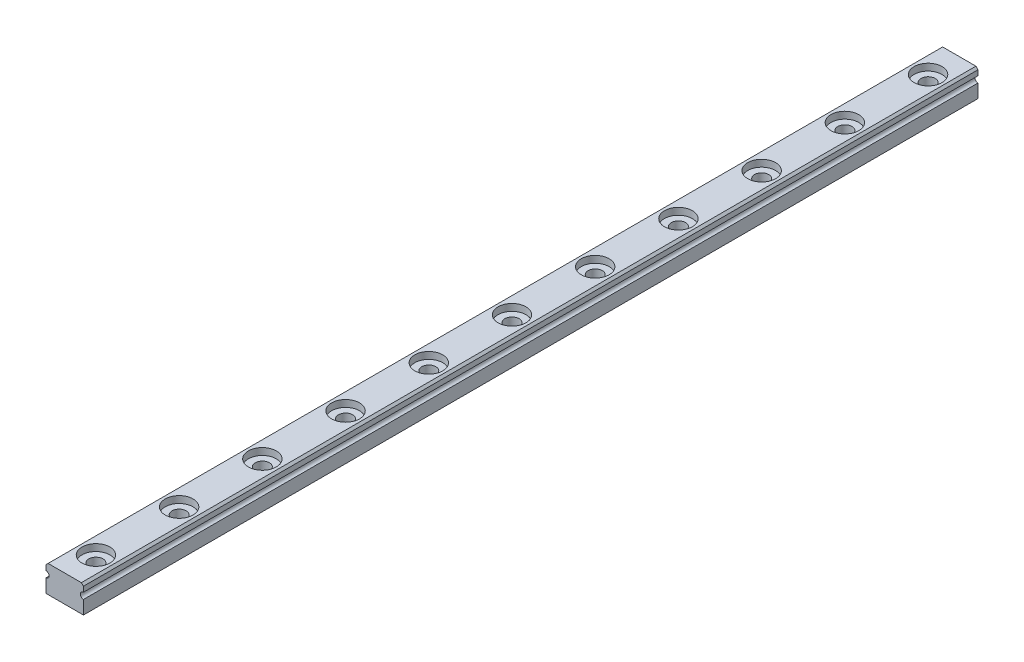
ISO-10303-21;
HEADER;
FILE_DESCRIPTION(('STEP AP214'),'2;1');
FILE_NAME('part.step','',(''),(''),'','','');
FILE_SCHEMA(('AUTOMOTIVE_DESIGN { 1 0 10303 214 1 1 1 1 }'));
ENDSEC;
DATA;
#1=APPLICATION_CONTEXT('core data for automotive mechanical design processes');
#2=APPLICATION_PROTOCOL_DEFINITION('international standard','automotive_design',2000,#1);
#3=PRODUCT_CONTEXT('',#1,'mechanical');
#4=PRODUCT('Part','Part','',(#3));
#5=PRODUCT_RELATED_PRODUCT_CATEGORY('part','',(#4));
#6=PRODUCT_DEFINITION_FORMATION('','',#4);
#7=PRODUCT_DEFINITION_CONTEXT('part definition',#1,'design');
#8=PRODUCT_DEFINITION('design','',#6,#7);
#9=PRODUCT_DEFINITION_SHAPE('','',#8);
#10=(LENGTH_UNIT() NAMED_UNIT(*) SI_UNIT(.MILLI.,.METRE.));
#11=(NAMED_UNIT(*) PLANE_ANGLE_UNIT() SI_UNIT($,.RADIAN.));
#12=(NAMED_UNIT(*) SI_UNIT($,.STERADIAN.) SOLID_ANGLE_UNIT());
#13=UNCERTAINTY_MEASURE_WITH_UNIT(LENGTH_MEASURE(1.E-05),#10,'distance_accuracy_value','');
#14=(GEOMETRIC_REPRESENTATION_CONTEXT(3) GLOBAL_UNCERTAINTY_ASSIGNED_CONTEXT((#13)) GLOBAL_UNIT_ASSIGNED_CONTEXT((#10,
#11,#12)) REPRESENTATION_CONTEXT('',''));
#15=CARTESIAN_POINT('',(0.,0.,0.));
#16=DIRECTION('',(0.,0.,1.));
#17=DIRECTION('',(1.,0.,0.));
#18=AXIS2_PLACEMENT_3D('',#15,#16,#17);
#19=CARTESIAN_POINT('',(0.,0.,215.));
#20=DIRECTION('',(1.,0.,0.));
#21=DIRECTION('',(0.,1.,0.));
#22=AXIS2_PLACEMENT_3D('',#19,#20,#21);
#23=PLANE('',#22);
#24=DIRECTION('',(0.,-1.,0.));
#25=VECTOR('',#24,1.);
#26=CARTESIAN_POINT('',(0.,0.,0.));
#27=LINE('',#26,#25);
#28=CARTESIAN_POINT('',(0.,3.25,0.));
#29=VERTEX_POINT('',#28);
#30=CARTESIAN_POINT('',(0.,0.,0.));
#31=VERTEX_POINT('',#30);
#32=EDGE_CURVE('E144',#29,#31,#27,.T.);
#33=ORIENTED_EDGE('',*,*,#32,.T.);
#34=DIRECTION('',(0.,0.,-1.));
#35=VECTOR('',#34,1.);
#36=CARTESIAN_POINT('',(0.,0.,215.));
#37=LINE('',#36,#35);
#38=CARTESIAN_POINT('',(0.,0.,215.));
#39=VERTEX_POINT('',#38);
#40=EDGE_CURVE('E125',#39,#31,#37,.T.);
#41=ORIENTED_EDGE('',*,*,#40,.F.);
#42=DIRECTION('',(0.,-1.,0.));
#43=VECTOR('',#42,1.);
#44=CARTESIAN_POINT('',(0.,0.,215.));
#45=LINE('',#44,#43);
#46=CARTESIAN_POINT('',(0.,3.25,215.));
#47=VERTEX_POINT('',#46);
#48=EDGE_CURVE('E132',#47,#39,#45,.T.);
#49=ORIENTED_EDGE('',*,*,#48,.F.);
#50=DIRECTION('',(0.,0.,-1.));
#51=VECTOR('',#50,1.);
#52=CARTESIAN_POINT('',(0.,3.25,215.));
#53=LINE('',#52,#51);
#54=EDGE_CURVE('E192',#47,#29,#53,.T.);
#55=ORIENTED_EDGE('',*,*,#54,.T.);
#56=EDGE_LOOP('',(#33,#41,#49,#55));
#57=FACE_BOUND('',#56,.T.);
#58=ADVANCED_FACE('F41',(#57),#23,.F.);
#59=CARTESIAN_POINT('',(0.,0.,215.));
#60=DIRECTION('',(0.,1.,0.));
#61=DIRECTION('',(0.,0.,1.));
#62=AXIS2_PLACEMENT_3D('',#59,#60,#61);
#63=PLANE('',#62);
#64=CARTESIAN_POINT('',(4.5,0.,187.5));
#65=DIRECTION('',(0.,1.,0.));
#66=DIRECTION('',(-1.,0.,0.));
#67=AXIS2_PLACEMENT_3D('',#64,#65,#66);
#68=CIRCLE('',#67,1.7);
#69=CARTESIAN_POINT('',(2.8,0.,187.5));
#70=VERTEX_POINT('',#69);
#71=EDGE_CURVE('E347',#70,#70,#68,.T.);
#72=ORIENTED_EDGE('',*,*,#71,.T.);
#73=EDGE_LOOP('',(#72));
#74=FACE_BOUND('',#73,.T.);
#75=CARTESIAN_POINT('',(4.5,0.,167.5));
#76=DIRECTION('',(0.,1.,0.));
#77=DIRECTION('',(-1.,0.,0.));
#78=AXIS2_PLACEMENT_3D('',#75,#76,#77);
#79=CIRCLE('',#78,1.7);
#80=CARTESIAN_POINT('',(2.8,0.,167.5));
#81=VERTEX_POINT('',#80);
#82=EDGE_CURVE('E337',#81,#81,#79,.T.);
#83=ORIENTED_EDGE('',*,*,#82,.T.);
#84=EDGE_LOOP('',(#83));
#85=FACE_BOUND('',#84,.T.);
#86=CARTESIAN_POINT('',(4.5,0.,147.5));
#87=DIRECTION('',(0.,1.,0.));
#88=DIRECTION('',(-1.,0.,0.));
#89=AXIS2_PLACEMENT_3D('',#86,#87,#88);
#90=CIRCLE('',#89,1.7);
#91=CARTESIAN_POINT('',(2.8,0.,147.5));
#92=VERTEX_POINT('',#91);
#93=EDGE_CURVE('E325',#92,#92,#90,.T.);
#94=ORIENTED_EDGE('',*,*,#93,.T.);
#95=EDGE_LOOP('',(#94));
#96=FACE_BOUND('',#95,.T.);
#97=CARTESIAN_POINT('',(4.5,0.,127.5));
#98=DIRECTION('',(0.,1.,0.));
#99=DIRECTION('',(-1.,0.,0.));
#100=AXIS2_PLACEMENT_3D('',#97,#98,#99);
#101=CIRCLE('',#100,1.7);
#102=CARTESIAN_POINT('',(2.8,0.,127.5));
#103=VERTEX_POINT('',#102);
#104=EDGE_CURVE('E313',#103,#103,#101,.T.);
#105=ORIENTED_EDGE('',*,*,#104,.T.);
#106=EDGE_LOOP('',(#105));
#107=FACE_BOUND('',#106,.T.);
#108=CARTESIAN_POINT('',(4.5,0.,107.5));
#109=DIRECTION('',(0.,1.,0.));
#110=DIRECTION('',(-1.,0.,0.));
#111=AXIS2_PLACEMENT_3D('',#108,#109,#110);
#112=CIRCLE('',#111,1.7);
#113=CARTESIAN_POINT('',(2.8,0.,107.5));
#114=VERTEX_POINT('',#113);
#115=EDGE_CURVE('E301',#114,#114,#112,.T.);
#116=ORIENTED_EDGE('',*,*,#115,.T.);
#117=EDGE_LOOP('',(#116));
#118=FACE_BOUND('',#117,.T.);
#119=CARTESIAN_POINT('',(4.5,0.,87.5));
#120=DIRECTION('',(0.,1.,0.));
#121=DIRECTION('',(-1.,0.,0.));
#122=AXIS2_PLACEMENT_3D('',#119,#120,#121);
#123=CIRCLE('',#122,1.7);
#124=CARTESIAN_POINT('',(2.8,0.,87.5));
#125=VERTEX_POINT('',#124);
#126=EDGE_CURVE('E289',#125,#125,#123,.T.);
#127=ORIENTED_EDGE('',*,*,#126,.T.);
#128=EDGE_LOOP('',(#127));
#129=FACE_BOUND('',#128,.T.);
#130=CARTESIAN_POINT('',(4.5,0.,67.5));
#131=DIRECTION('',(0.,1.,0.));
#132=DIRECTION('',(-1.,0.,0.));
#133=AXIS2_PLACEMENT_3D('',#130,#131,#132);
#134=CIRCLE('',#133,1.7);
#135=CARTESIAN_POINT('',(2.8,0.,67.5));
#136=VERTEX_POINT('',#135);
#137=EDGE_CURVE('E277',#136,#136,#134,.T.);
#138=ORIENTED_EDGE('',*,*,#137,.T.);
#139=EDGE_LOOP('',(#138));
#140=FACE_BOUND('',#139,.T.);
#141=CARTESIAN_POINT('',(4.5,0.,47.5));
#142=DIRECTION('',(0.,1.,0.));
#143=DIRECTION('',(-1.,0.,0.));
#144=AXIS2_PLACEMENT_3D('',#141,#142,#143);
#145=CIRCLE('',#144,1.7);
#146=CARTESIAN_POINT('',(2.8,0.,47.5));
#147=VERTEX_POINT('',#146);
#148=EDGE_CURVE('E265',#147,#147,#145,.T.);
#149=ORIENTED_EDGE('',*,*,#148,.T.);
#150=EDGE_LOOP('',(#149));
#151=FACE_BOUND('',#150,.T.);
#152=CARTESIAN_POINT('',(4.5,0.,27.5));
#153=DIRECTION('',(0.,1.,0.));
#154=DIRECTION('',(-1.,0.,0.));
#155=AXIS2_PLACEMENT_3D('',#152,#153,#154);
#156=CIRCLE('',#155,1.7);
#157=CARTESIAN_POINT('',(2.8,0.,27.5));
#158=VERTEX_POINT('',#157);
#159=EDGE_CURVE('E253',#158,#158,#156,.T.);
#160=ORIENTED_EDGE('',*,*,#159,.T.);
#161=EDGE_LOOP('',(#160));
#162=FACE_BOUND('',#161,.T.);
#163=CARTESIAN_POINT('',(4.5,0.,7.49999999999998));
#164=DIRECTION('',(0.,1.,0.));
#165=DIRECTION('',(-1.,0.,0.));
#166=AXIS2_PLACEMENT_3D('',#163,#164,#165);
#167=CIRCLE('',#166,1.7);
#168=CARTESIAN_POINT('',(2.8,0.,7.49999999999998));
#169=VERTEX_POINT('',#168);
#170=EDGE_CURVE('E240',#169,#169,#167,.T.);
#171=ORIENTED_EDGE('',*,*,#170,.T.);
#172=EDGE_LOOP('',(#171));
#173=FACE_BOUND('',#172,.T.);
#174=CARTESIAN_POINT('',(4.5,0.,207.5));
#175=DIRECTION('',(0.,1.,0.));
#176=DIRECTION('',(-1.,0.,0.));
#177=AXIS2_PLACEMENT_3D('',#174,#175,#176);
#178=CIRCLE('',#177,1.7);
#179=CARTESIAN_POINT('',(2.8,0.,207.5));
#180=VERTEX_POINT('',#179);
#181=EDGE_CURVE('E214',#180,#180,#178,.T.);
#182=ORIENTED_EDGE('',*,*,#181,.T.);
#183=EDGE_LOOP('',(#182));
#184=FACE_BOUND('',#183,.T.);
#185=DIRECTION('',(1.,0.,0.));
#186=VECTOR('',#185,1.);
#187=CARTESIAN_POINT('',(0.,0.,0.));
#188=LINE('',#187,#186);
#189=CARTESIAN_POINT('',(9.,0.,0.));
#190=VERTEX_POINT('',#189);
#191=EDGE_CURVE('E209',#31,#190,#188,.T.);
#192=ORIENTED_EDGE('',*,*,#191,.T.);
#193=DIRECTION('',(0.,0.,-1.));
#194=VECTOR('',#193,1.);
#195=CARTESIAN_POINT('',(9.,0.,215.));
#196=LINE('',#195,#194);
#197=CARTESIAN_POINT('',(9.,0.,215.));
#198=VERTEX_POINT('',#197);
#199=EDGE_CURVE('E128',#198,#190,#196,.T.);
#200=ORIENTED_EDGE('',*,*,#199,.F.);
#201=DIRECTION('',(1.,0.,0.));
#202=VECTOR('',#201,1.);
#203=CARTESIAN_POINT('',(0.,0.,215.));
#204=LINE('',#203,#202);
#205=EDGE_CURVE('E121',#39,#198,#204,.T.);
#206=ORIENTED_EDGE('',*,*,#205,.F.);
#207=ORIENTED_EDGE('',*,*,#40,.T.);
#208=EDGE_LOOP('',(#192,#200,#206,#207));
#209=FACE_BOUND('',#208,.T.);
#210=ADVANCED_FACE('F123',(#74,#85,#96,#107,#118,#129,#140,#151,#162,#173,#184,#209),#63,.F.);
#211=CARTESIAN_POINT('',(9.,0.,215.));
#212=DIRECTION('',(-1.,0.,0.));
#213=DIRECTION('',(0.,-1.,0.));
#214=AXIS2_PLACEMENT_3D('',#211,#212,#213);
#215=PLANE('',#214);
#216=DIRECTION('',(0.,1.,0.));
#217=VECTOR('',#216,1.);
#218=CARTESIAN_POINT('',(9.,0.,0.));
#219=LINE('',#218,#217);
#220=CARTESIAN_POINT('',(9.,3.25,0.));
#221=VERTEX_POINT('',#220);
#222=EDGE_CURVE('E208',#190,#221,#219,.T.);
#223=ORIENTED_EDGE('',*,*,#222,.T.);
#224=DIRECTION('',(0.,0.,-1.));
#225=VECTOR('',#224,1.);
#226=CARTESIAN_POINT('',(9.,3.25,215.));
#227=LINE('',#226,#225);
#228=CARTESIAN_POINT('',(9.,3.25,215.));
#229=VERTEX_POINT('',#228);
#230=EDGE_CURVE('E150',#229,#221,#227,.T.);
#231=ORIENTED_EDGE('',*,*,#230,.F.);
#232=DIRECTION('',(0.,1.,0.));
#233=VECTOR('',#232,1.);
#234=CARTESIAN_POINT('',(9.,0.,215.));
#235=LINE('',#234,#233);
#236=EDGE_CURVE('E131',#198,#229,#235,.T.);
#237=ORIENTED_EDGE('',*,*,#236,.F.);
#238=ORIENTED_EDGE('',*,*,#199,.T.);
#239=EDGE_LOOP('',(#223,#231,#237,#238));
#240=FACE_BOUND('',#239,.T.);
#241=ADVANCED_FACE('F410',(#240),#215,.F.);
#242=CARTESIAN_POINT('',(9.,4.,215.));
#243=DIRECTION('',(0.,0.,-1.));
#244=DIRECTION('',(-1.,0.,0.));
#245=AXIS2_PLACEMENT_3D('',#242,#243,#244);
#246=CYLINDRICAL_SURFACE('',#245,0.75);
#247=CARTESIAN_POINT('',(9.,4.,0.));
#248=DIRECTION('',(0.,0.,-1.));
#249=DIRECTION('',(-1.,0.,0.));
#250=AXIS2_PLACEMENT_3D('',#247,#248,#249);
#251=CIRCLE('',#250,0.75);
#252=CARTESIAN_POINT('',(9.,4.75,0.));
#253=VERTEX_POINT('',#252);
#254=EDGE_CURVE('E187',#221,#253,#251,.T.);
#255=ORIENTED_EDGE('',*,*,#254,.T.);
#256=DIRECTION('',(0.,0.,-1.));
#257=VECTOR('',#256,1.);
#258=CARTESIAN_POINT('',(9.,4.75,215.));
#259=LINE('',#258,#257);
#260=CARTESIAN_POINT('',(9.,4.75,215.));
#261=VERTEX_POINT('',#260);
#262=EDGE_CURVE('E195',#261,#253,#259,.T.);
#263=ORIENTED_EDGE('',*,*,#262,.F.);
#264=CARTESIAN_POINT('',(9.,4.,215.));
#265=DIRECTION('',(0.,0.,-1.));
#266=DIRECTION('',(-1.,0.,0.));
#267=AXIS2_PLACEMENT_3D('',#264,#265,#266);
#268=CIRCLE('',#267,0.75);
#269=EDGE_CURVE('E204',#229,#261,#268,.T.);
#270=ORIENTED_EDGE('',*,*,#269,.F.);
#271=ORIENTED_EDGE('',*,*,#230,.T.);
#272=EDGE_LOOP('',(#255,#263,#270,#271));
#273=FACE_BOUND('',#272,.T.);
#274=ADVANCED_FACE('F202',(#273),#246,.F.);
#275=CARTESIAN_POINT('',(9.,4.75,215.));
#276=DIRECTION('',(-1.,0.,0.));
#277=DIRECTION('',(0.,0.,1.));
#278=AXIS2_PLACEMENT_3D('',#275,#276,#277);
#279=PLANE('',#278);
#280=DIRECTION('',(0.,1.,0.));
#281=VECTOR('',#280,1.);
#282=CARTESIAN_POINT('',(9.,4.75,0.));
#283=LINE('',#282,#281);
#284=CARTESIAN_POINT('',(9.,6.,0.));
#285=VERTEX_POINT('',#284);
#286=EDGE_CURVE('E184',#253,#285,#283,.T.);
#287=ORIENTED_EDGE('',*,*,#286,.T.);
#288=DIRECTION('',(0.,0.,1.));
#289=VECTOR('',#288,1.);
#290=CARTESIAN_POINT('',(9.,6.,215.));
#291=LINE('',#290,#289);
#292=CARTESIAN_POINT('',(9.,6.,215.));
#293=VERTEX_POINT('',#292);
#294=EDGE_CURVE('E11',#285,#293,#291,.T.);
#295=ORIENTED_EDGE('',*,*,#294,.T.);
#296=DIRECTION('',(0.,1.,0.));
#297=VECTOR('',#296,1.);
#298=CARTESIAN_POINT('',(9.,4.75,215.));
#299=LINE('',#298,#297);
#300=EDGE_CURVE('E217',#261,#293,#299,.T.);
#301=ORIENTED_EDGE('',*,*,#300,.F.);
#302=ORIENTED_EDGE('',*,*,#262,.T.);
#303=EDGE_LOOP('',(#287,#295,#301,#302));
#304=FACE_BOUND('',#303,.T.);
#305=ADVANCED_FACE('F358',(#304),#279,.F.);
#306=CARTESIAN_POINT('',(0.,6.5,215.));
#307=DIRECTION('',(0.,-1.,0.));
#308=DIRECTION('',(1.,0.,0.));
#309=AXIS2_PLACEMENT_3D('',#306,#307,#308);
#310=PLANE('',#309);
#311=CARTESIAN_POINT('',(4.5,6.5,187.5));
#312=DIRECTION('',(0.,1.,0.));
#313=DIRECTION('',(-1.,0.,0.));
#314=AXIS2_PLACEMENT_3D('',#311,#312,#313);
#315=CIRCLE('',#314,3.35);
#316=CARTESIAN_POINT('',(1.15,6.5,187.5));
#317=VERTEX_POINT('',#316);
#318=EDGE_CURVE('E333',#317,#317,#315,.T.);
#319=ORIENTED_EDGE('',*,*,#318,.F.);
#320=EDGE_LOOP('',(#319));
#321=FACE_BOUND('',#320,.T.);
#322=CARTESIAN_POINT('',(4.5,6.5,167.5));
#323=DIRECTION('',(0.,1.,0.));
#324=DIRECTION('',(-1.,0.,0.));
#325=AXIS2_PLACEMENT_3D('',#322,#323,#324);
#326=CIRCLE('',#325,3.35);
#327=CARTESIAN_POINT('',(1.15,6.5,167.5));
#328=VERTEX_POINT('',#327);
#329=EDGE_CURVE('E321',#328,#328,#326,.T.);
#330=ORIENTED_EDGE('',*,*,#329,.F.);
#331=EDGE_LOOP('',(#330));
#332=FACE_BOUND('',#331,.T.);
#333=CARTESIAN_POINT('',(4.5,6.5,147.5));
#334=DIRECTION('',(0.,1.,0.));
#335=DIRECTION('',(-1.,0.,0.));
#336=AXIS2_PLACEMENT_3D('',#333,#334,#335);
#337=CIRCLE('',#336,3.35);
#338=CARTESIAN_POINT('',(1.15,6.5,147.5));
#339=VERTEX_POINT('',#338);
#340=EDGE_CURVE('E309',#339,#339,#337,.T.);
#341=ORIENTED_EDGE('',*,*,#340,.F.);
#342=EDGE_LOOP('',(#341));
#343=FACE_BOUND('',#342,.T.);
#344=CARTESIAN_POINT('',(4.5,6.5,127.5));
#345=DIRECTION('',(0.,1.,0.));
#346=DIRECTION('',(-1.,0.,0.));
#347=AXIS2_PLACEMENT_3D('',#344,#345,#346);
#348=CIRCLE('',#347,3.35);
#349=CARTESIAN_POINT('',(1.15,6.5,127.5));
#350=VERTEX_POINT('',#349);
#351=EDGE_CURVE('E297',#350,#350,#348,.T.);
#352=ORIENTED_EDGE('',*,*,#351,.F.);
#353=EDGE_LOOP('',(#352));
#354=FACE_BOUND('',#353,.T.);
#355=CARTESIAN_POINT('',(4.5,6.5,107.5));
#356=DIRECTION('',(0.,1.,0.));
#357=DIRECTION('',(-1.,0.,0.));
#358=AXIS2_PLACEMENT_3D('',#355,#356,#357);
#359=CIRCLE('',#358,3.35);
#360=CARTESIAN_POINT('',(1.15,6.5,107.5));
#361=VERTEX_POINT('',#360);
#362=EDGE_CURVE('E285',#361,#361,#359,.T.);
#363=ORIENTED_EDGE('',*,*,#362,.F.);
#364=EDGE_LOOP('',(#363));
#365=FACE_BOUND('',#364,.T.);
#366=CARTESIAN_POINT('',(4.5,6.5,87.5));
#367=DIRECTION('',(0.,1.,0.));
#368=DIRECTION('',(-1.,0.,0.));
#369=AXIS2_PLACEMENT_3D('',#366,#367,#368);
#370=CIRCLE('',#369,3.35);
#371=CARTESIAN_POINT('',(1.15,6.5,87.5));
#372=VERTEX_POINT('',#371);
#373=EDGE_CURVE('E273',#372,#372,#370,.T.);
#374=ORIENTED_EDGE('',*,*,#373,.F.);
#375=EDGE_LOOP('',(#374));
#376=FACE_BOUND('',#375,.T.);
#377=CARTESIAN_POINT('',(4.5,6.5,67.5));
#378=DIRECTION('',(0.,1.,0.));
#379=DIRECTION('',(-1.,0.,0.));
#380=AXIS2_PLACEMENT_3D('',#377,#378,#379);
#381=CIRCLE('',#380,3.35);
#382=CARTESIAN_POINT('',(1.15,6.5,67.5));
#383=VERTEX_POINT('',#382);
#384=EDGE_CURVE('E261',#383,#383,#381,.T.);
#385=ORIENTED_EDGE('',*,*,#384,.F.);
#386=EDGE_LOOP('',(#385));
#387=FACE_BOUND('',#386,.T.);
#388=CARTESIAN_POINT('',(4.5,6.5,47.5));
#389=DIRECTION('',(0.,1.,0.));
#390=DIRECTION('',(-1.,0.,0.));
#391=AXIS2_PLACEMENT_3D('',#388,#389,#390);
#392=CIRCLE('',#391,3.35);
#393=CARTESIAN_POINT('',(1.15,6.5,47.5));
#394=VERTEX_POINT('',#393);
#395=EDGE_CURVE('E249',#394,#394,#392,.T.);
#396=ORIENTED_EDGE('',*,*,#395,.F.);
#397=EDGE_LOOP('',(#396));
#398=FACE_BOUND('',#397,.T.);
#399=CARTESIAN_POINT('',(4.5,6.5,27.5));
#400=DIRECTION('',(0.,1.,0.));
#401=DIRECTION('',(-1.,0.,0.));
#402=AXIS2_PLACEMENT_3D('',#399,#400,#401);
#403=CIRCLE('',#402,3.35);
#404=CARTESIAN_POINT('',(1.15,6.5,27.5));
#405=VERTEX_POINT('',#404);
#406=EDGE_CURVE('E236',#405,#405,#403,.T.);
#407=ORIENTED_EDGE('',*,*,#406,.F.);
#408=EDGE_LOOP('',(#407));
#409=FACE_BOUND('',#408,.T.);
#410=CARTESIAN_POINT('',(4.5,6.5,7.49999999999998));
#411=DIRECTION('',(0.,1.,0.));
#412=DIRECTION('',(-1.,0.,0.));
#413=AXIS2_PLACEMENT_3D('',#410,#411,#412);
#414=CIRCLE('',#413,3.35);
#415=CARTESIAN_POINT('',(1.15,6.5,7.49999999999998));
#416=VERTEX_POINT('',#415);
#417=EDGE_CURVE('E243',#416,#416,#414,.T.);
#418=ORIENTED_EDGE('',*,*,#417,.F.);
#419=EDGE_LOOP('',(#418));
#420=FACE_BOUND('',#419,.T.);
#421=CARTESIAN_POINT('',(4.5,6.5,207.5));
#422=DIRECTION('',(0.,1.,0.));
#423=DIRECTION('',(-1.,0.,0.));
#424=AXIS2_PLACEMENT_3D('',#421,#422,#423);
#425=CIRCLE('',#424,3.35);
#426=CARTESIAN_POINT('',(1.15,6.5,207.5));
#427=VERTEX_POINT('',#426);
#428=EDGE_CURVE('E229',#427,#427,#425,.T.);
#429=ORIENTED_EDGE('',*,*,#428,.F.);
#430=EDGE_LOOP('',(#429));
#431=FACE_BOUND('',#430,.T.);
#432=DIRECTION('',(-1.,0.,0.));
#433=VECTOR('',#432,1.);
#434=CARTESIAN_POINT('',(0.,6.5,0.));
#435=LINE('',#434,#433);
#436=CARTESIAN_POINT('',(8.5,6.5,0.));
#437=VERTEX_POINT('',#436);
#438=CARTESIAN_POINT('',(0.499999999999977,6.5,0.));
#439=VERTEX_POINT('',#438);
#440=EDGE_CURVE('E179',#437,#439,#435,.T.);
#441=ORIENTED_EDGE('',*,*,#440,.T.);
#442=DIRECTION('',(0.,0.,1.));
#443=VECTOR('',#442,1.);
#444=CARTESIAN_POINT('',(0.499999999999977,6.5,215.));
#445=LINE('',#444,#443);
#446=CARTESIAN_POINT('',(0.499999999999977,6.5,215.));
#447=VERTEX_POINT('',#446);
#448=EDGE_CURVE('E63',#439,#447,#445,.T.);
#449=ORIENTED_EDGE('',*,*,#448,.T.);
#450=DIRECTION('',(-1.,0.,0.));
#451=VECTOR('',#450,1.);
#452=CARTESIAN_POINT('',(0.,6.5,215.));
#453=LINE('',#452,#451);
#454=CARTESIAN_POINT('',(8.5,6.5,215.));
#455=VERTEX_POINT('',#454);
#456=EDGE_CURVE('E166',#455,#447,#453,.T.);
#457=ORIENTED_EDGE('',*,*,#456,.F.);
#458=DIRECTION('',(0.,0.,-1.));
#459=VECTOR('',#458,1.);
#460=CARTESIAN_POINT('',(8.5,6.5,215.));
#461=LINE('',#460,#459);
#462=EDGE_CURVE('E157',#455,#437,#461,.T.);
#463=ORIENTED_EDGE('',*,*,#462,.T.);
#464=EDGE_LOOP('',(#441,#449,#457,#463));
#465=FACE_BOUND('',#464,.T.);
#466=ADVANCED_FACE('F182',(#321,#332,#343,#354,#365,#376,#387,#398,#409,#420,#431,#465),#310,.F.);
#467=CARTESIAN_POINT('',(0.,4.75,215.));
#468=DIRECTION('',(1.,0.,0.));
#469=DIRECTION('',(0.,1.,0.));
#470=AXIS2_PLACEMENT_3D('',#467,#468,#469);
#471=PLANE('',#470);
#472=DIRECTION('',(0.,-1.,0.));
#473=VECTOR('',#472,1.);
#474=CARTESIAN_POINT('',(0.,4.75,215.));
#475=LINE('',#474,#473);
#476=CARTESIAN_POINT('',(0.,6.00000000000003,215.));
#477=VERTEX_POINT('',#476);
#478=CARTESIAN_POINT('',(0.,4.75,215.));
#479=VERTEX_POINT('',#478);
#480=EDGE_CURVE('E164',#477,#479,#475,.T.);
#481=ORIENTED_EDGE('',*,*,#480,.F.);
#482=DIRECTION('',(0.,0.,-1.));
#483=VECTOR('',#482,1.);
#484=CARTESIAN_POINT('',(0.,6.00000000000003,215.));
#485=LINE('',#484,#483);
#486=CARTESIAN_POINT('',(0.,6.00000000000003,0.));
#487=VERTEX_POINT('',#486);
#488=EDGE_CURVE('E145',#477,#487,#485,.T.);
#489=ORIENTED_EDGE('',*,*,#488,.T.);
#490=DIRECTION('',(0.,-1.,0.));
#491=VECTOR('',#490,1.);
#492=CARTESIAN_POINT('',(0.,4.75,0.));
#493=LINE('',#492,#491);
#494=CARTESIAN_POINT('',(0.,4.75,0.));
#495=VERTEX_POINT('',#494);
#496=EDGE_CURVE('E181',#487,#495,#493,.T.);
#497=ORIENTED_EDGE('',*,*,#496,.T.);
#498=DIRECTION('',(0.,0.,-1.));
#499=VECTOR('',#498,1.);
#500=CARTESIAN_POINT('',(0.,4.75,215.));
#501=LINE('',#500,#499);
#502=EDGE_CURVE('E173',#479,#495,#501,.T.);
#503=ORIENTED_EDGE('',*,*,#502,.F.);
#504=EDGE_LOOP('',(#481,#489,#497,#503));
#505=FACE_BOUND('',#504,.T.);
#506=ADVANCED_FACE('F170',(#505),#471,.F.);
#507=CARTESIAN_POINT('',(0.,4.,215.));
#508=DIRECTION('',(0.,0.,-1.));
#509=DIRECTION('',(-1.,0.,0.));
#510=AXIS2_PLACEMENT_3D('',#507,#508,#509);
#511=CYLINDRICAL_SURFACE('',#510,0.75);
#512=CARTESIAN_POINT('',(0.,4.,0.));
#513=DIRECTION('',(0.,0.,-1.));
#514=DIRECTION('',(1.,0.,0.));
#515=AXIS2_PLACEMENT_3D('',#512,#513,#514);
#516=CIRCLE('',#515,0.75);
#517=EDGE_CURVE('E141',#495,#29,#516,.T.);
#518=ORIENTED_EDGE('',*,*,#517,.T.);
#519=ORIENTED_EDGE('',*,*,#54,.F.);
#520=CARTESIAN_POINT('',(0.,4.,215.));
#521=DIRECTION('',(0.,0.,-1.));
#522=DIRECTION('',(1.,0.,0.));
#523=AXIS2_PLACEMENT_3D('',#520,#521,#522);
#524=CIRCLE('',#523,0.75);
#525=EDGE_CURVE('E137',#479,#47,#524,.T.);
#526=ORIENTED_EDGE('',*,*,#525,.F.);
#527=ORIENTED_EDGE('',*,*,#502,.T.);
#528=EDGE_LOOP('',(#518,#519,#526,#527));
#529=FACE_BOUND('',#528,.T.);
#530=ADVANCED_FACE('F762',(#529),#511,.F.);
#531=CARTESIAN_POINT('',(0.,4.,215.));
#532=DIRECTION('',(0.,0.,1.));
#533=DIRECTION('',(1.,0.,0.));
#534=AXIS2_PLACEMENT_3D('',#531,#532,#533);
#535=PLANE('',#534);
#536=ORIENTED_EDGE('',*,*,#456,.T.);
#537=DIRECTION('',(0.707106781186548,0.707106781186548,0.));
#538=VECTOR('',#537,1.);
#539=CARTESIAN_POINT('',(-1.00000000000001,5.00000000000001,215.));
#540=LINE('',#539,#538);
#541=EDGE_CURVE('E50',#447,#477,#540,.F.);
#542=ORIENTED_EDGE('',*,*,#541,.T.);
#543=ORIENTED_EDGE('',*,*,#480,.T.);
#544=ORIENTED_EDGE('',*,*,#525,.T.);
#545=ORIENTED_EDGE('',*,*,#48,.T.);
#546=ORIENTED_EDGE('',*,*,#205,.T.);
#547=ORIENTED_EDGE('',*,*,#236,.T.);
#548=ORIENTED_EDGE('',*,*,#269,.T.);
#549=ORIENTED_EDGE('',*,*,#300,.T.);
#550=DIRECTION('',(0.707106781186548,-0.707106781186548,0.));
#551=VECTOR('',#550,1.);
#552=CARTESIAN_POINT('',(5.5,9.5,215.));
#553=LINE('',#552,#551);
#554=EDGE_CURVE('E161',#293,#455,#553,.F.);
#555=ORIENTED_EDGE('',*,*,#554,.T.);
#556=EDGE_LOOP('',(#536,#542,#543,#544,#545,#546,#547,#548,#549,#555));
#557=FACE_BOUND('',#556,.T.);
#558=ADVANCED_FACE('F135',(#557),#535,.T.);
#559=CARTESIAN_POINT('',(0.,4.,0.));
#560=DIRECTION('',(0.,0.,1.));
#561=DIRECTION('',(1.,0.,0.));
#562=AXIS2_PLACEMENT_3D('',#559,#560,#561);
#563=PLANE('',#562);
#564=ORIENTED_EDGE('',*,*,#496,.F.);
#565=DIRECTION('',(-0.707106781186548,-0.707106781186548,0.));
#566=VECTOR('',#565,1.);
#567=CARTESIAN_POINT('',(0.,6.00000000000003,0.));
#568=LINE('',#567,#566);
#569=EDGE_CURVE('E155',#487,#439,#568,.F.);
#570=ORIENTED_EDGE('',*,*,#569,.T.);
#571=ORIENTED_EDGE('',*,*,#440,.F.);
#572=DIRECTION('',(-0.707106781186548,0.707106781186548,0.));
#573=VECTOR('',#572,1.);
#574=CARTESIAN_POINT('',(8.5,6.5,0.));
#575=LINE('',#574,#573);
#576=EDGE_CURVE('E148',#437,#285,#575,.F.);
#577=ORIENTED_EDGE('',*,*,#576,.T.);
#578=ORIENTED_EDGE('',*,*,#286,.F.);
#579=ORIENTED_EDGE('',*,*,#254,.F.);
#580=ORIENTED_EDGE('',*,*,#222,.F.);
#581=ORIENTED_EDGE('',*,*,#191,.F.);
#582=ORIENTED_EDGE('',*,*,#32,.F.);
#583=ORIENTED_EDGE('',*,*,#517,.F.);
#584=EDGE_LOOP('',(#564,#570,#571,#577,#578,#579,#580,#581,#582,#583));
#585=FACE_BOUND('',#584,.T.);
#586=ADVANCED_FACE('F178',(#585),#563,.F.);
#587=CARTESIAN_POINT('',(4.5,6.5,207.5));
#588=DIRECTION('',(0.,1.,0.));
#589=DIRECTION('',(-1.,0.,0.));
#590=AXIS2_PLACEMENT_3D('',#587,#588,#589);
#591=CYLINDRICAL_SURFACE('',#590,1.7);
#592=ORIENTED_EDGE('',*,*,#181,.F.);
#593=EDGE_LOOP('',(#592));
#594=FACE_BOUND('',#593,.T.);
#595=CARTESIAN_POINT('',(4.5,4.85,207.5));
#596=DIRECTION('',(0.,1.,0.));
#597=DIRECTION('',(-1.,0.,0.));
#598=AXIS2_PLACEMENT_3D('',#595,#596,#597);
#599=CIRCLE('',#598,1.7);
#600=CARTESIAN_POINT('',(2.8,4.85,207.5));
#601=VERTEX_POINT('',#600);
#602=EDGE_CURVE('E223',#601,#601,#599,.T.);
#603=ORIENTED_EDGE('',*,*,#602,.T.);
#604=EDGE_LOOP('',(#603));
#605=FACE_BOUND('',#604,.T.);
#606=ADVANCED_FACE('F390',(#594,#605),#591,.F.);
#607=CARTESIAN_POINT('',(0.,4.85,207.5));
#608=DIRECTION('',(0.,1.,0.));
#609=DIRECTION('',(-1.,0.,0.));
#610=AXIS2_PLACEMENT_3D('',#607,#608,#609);
#611=PLANE('',#610);
#612=CARTESIAN_POINT('',(4.5,4.85,207.5));
#613=DIRECTION('',(0.,1.,0.));
#614=DIRECTION('',(-1.,0.,0.));
#615=AXIS2_PLACEMENT_3D('',#612,#613,#614);
#616=CIRCLE('',#615,3.35);
#617=CARTESIAN_POINT('',(1.15,4.85,207.5));
#618=VERTEX_POINT('',#617);
#619=EDGE_CURVE('E226',#618,#618,#616,.T.);
#620=ORIENTED_EDGE('',*,*,#619,.T.);
#621=EDGE_LOOP('',(#620));
#622=FACE_BOUND('',#621,.T.);
#623=ORIENTED_EDGE('',*,*,#602,.F.);
#624=EDGE_LOOP('',(#623));
#625=FACE_BOUND('',#624,.T.);
#626=ADVANCED_FACE('F384',(#622,#625),#611,.T.);
#627=CARTESIAN_POINT('',(4.5,6.5,207.5));
#628=DIRECTION('',(0.,1.,0.));
#629=DIRECTION('',(-1.,0.,0.));
#630=AXIS2_PLACEMENT_3D('',#627,#628,#629);
#631=CYLINDRICAL_SURFACE('',#630,3.35);
#632=ORIENTED_EDGE('',*,*,#428,.T.);
#633=EDGE_LOOP('',(#632));
#634=FACE_BOUND('',#633,.T.);
#635=ORIENTED_EDGE('',*,*,#619,.F.);
#636=EDGE_LOOP('',(#635));
#637=FACE_BOUND('',#636,.T.);
#638=ADVANCED_FACE('F380',(#634,#637),#631,.F.);
#639=CARTESIAN_POINT('',(4.5,6.5,7.49999999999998));
#640=DIRECTION('',(0.,1.,0.));
#641=DIRECTION('',(-1.,0.,0.));
#642=AXIS2_PLACEMENT_3D('',#639,#640,#641);
#643=CYLINDRICAL_SURFACE('',#642,1.7);
#644=ORIENTED_EDGE('',*,*,#170,.F.);
#645=EDGE_LOOP('',(#644));
#646=FACE_BOUND('',#645,.T.);
#647=CARTESIAN_POINT('',(4.5,4.85,7.49999999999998));
#648=DIRECTION('',(0.,1.,0.));
#649=DIRECTION('',(-1.,0.,0.));
#650=AXIS2_PLACEMENT_3D('',#647,#648,#649);
#651=CIRCLE('',#650,1.7);
#652=CARTESIAN_POINT('',(2.8,4.85,7.49999999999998));
#653=VERTEX_POINT('',#652);
#654=EDGE_CURVE('E233',#653,#653,#651,.T.);
#655=ORIENTED_EDGE('',*,*,#654,.T.);
#656=EDGE_LOOP('',(#655));
#657=FACE_BOUND('',#656,.T.);
#658=ADVANCED_FACE('F383',(#646,#657),#643,.F.);
#659=CARTESIAN_POINT('',(0.,4.85,7.49999999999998));
#660=DIRECTION('',(0.,1.,0.));
#661=DIRECTION('',(-1.,0.,0.));
#662=AXIS2_PLACEMENT_3D('',#659,#660,#661);
#663=PLANE('',#662);
#664=CARTESIAN_POINT('',(4.5,4.85,7.49999999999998));
#665=DIRECTION('',(0.,1.,0.));
#666=DIRECTION('',(-1.,0.,0.));
#667=AXIS2_PLACEMENT_3D('',#664,#665,#666);
#668=CIRCLE('',#667,3.35);
#669=CARTESIAN_POINT('',(1.15,4.85,7.49999999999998));
#670=VERTEX_POINT('',#669);
#671=EDGE_CURVE('E237',#670,#670,#668,.T.);
#672=ORIENTED_EDGE('',*,*,#671,.T.);
#673=EDGE_LOOP('',(#672));
#674=FACE_BOUND('',#673,.T.);
#675=ORIENTED_EDGE('',*,*,#654,.F.);
#676=EDGE_LOOP('',(#675));
#677=FACE_BOUND('',#676,.T.);
#678=ADVANCED_FACE('F535',(#674,#677),#663,.T.);
#679=CARTESIAN_POINT('',(4.5,6.5,7.49999999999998));
#680=DIRECTION('',(0.,1.,0.));
#681=DIRECTION('',(-1.,0.,0.));
#682=AXIS2_PLACEMENT_3D('',#679,#680,#681);
#683=CYLINDRICAL_SURFACE('',#682,3.35);
#684=ORIENTED_EDGE('',*,*,#417,.T.);
#685=EDGE_LOOP('',(#684));
#686=FACE_BOUND('',#685,.T.);
#687=ORIENTED_EDGE('',*,*,#671,.F.);
#688=EDGE_LOOP('',(#687));
#689=FACE_BOUND('',#688,.T.);
#690=ADVANCED_FACE('F531',(#686,#689),#683,.F.);
#691=CARTESIAN_POINT('',(4.5,6.5,27.5));
#692=DIRECTION('',(0.,1.,0.));
#693=DIRECTION('',(-1.,0.,0.));
#694=AXIS2_PLACEMENT_3D('',#691,#692,#693);
#695=CYLINDRICAL_SURFACE('',#694,1.7);
#696=ORIENTED_EDGE('',*,*,#159,.F.);
#697=EDGE_LOOP('',(#696));
#698=FACE_BOUND('',#697,.T.);
#699=CARTESIAN_POINT('',(4.5,4.85,27.5));
#700=DIRECTION('',(0.,1.,0.));
#701=DIRECTION('',(-1.,0.,0.));
#702=AXIS2_PLACEMENT_3D('',#699,#700,#701);
#703=CIRCLE('',#702,1.7);
#704=CARTESIAN_POINT('',(2.8,4.85,27.5));
#705=VERTEX_POINT('',#704);
#706=EDGE_CURVE('E246',#705,#705,#703,.T.);
#707=ORIENTED_EDGE('',*,*,#706,.T.);
#708=EDGE_LOOP('',(#707));
#709=FACE_BOUND('',#708,.T.);
#710=ADVANCED_FACE('F527',(#698,#709),#695,.F.);
#711=CARTESIAN_POINT('',(0.,4.85,27.5));
#712=DIRECTION('',(0.,1.,0.));
#713=DIRECTION('',(-1.,0.,0.));
#714=AXIS2_PLACEMENT_3D('',#711,#712,#713);
#715=PLANE('',#714);
#716=CARTESIAN_POINT('',(4.5,4.85,27.5));
#717=DIRECTION('',(0.,1.,0.));
#718=DIRECTION('',(-1.,0.,0.));
#719=AXIS2_PLACEMENT_3D('',#716,#717,#718);
#720=CIRCLE('',#719,3.35);
#721=CARTESIAN_POINT('',(1.15,4.85,27.5));
#722=VERTEX_POINT('',#721);
#723=EDGE_CURVE('E250',#722,#722,#720,.T.);
#724=ORIENTED_EDGE('',*,*,#723,.T.);
#725=EDGE_LOOP('',(#724));
#726=FACE_BOUND('',#725,.T.);
#727=ORIENTED_EDGE('',*,*,#706,.F.);
#728=EDGE_LOOP('',(#727));
#729=FACE_BOUND('',#728,.T.);
#730=ADVANCED_FACE('F523',(#726,#729),#715,.T.);
#731=CARTESIAN_POINT('',(4.5,6.5,27.5));
#732=DIRECTION('',(0.,1.,0.));
#733=DIRECTION('',(-1.,0.,0.));
#734=AXIS2_PLACEMENT_3D('',#731,#732,#733);
#735=CYLINDRICAL_SURFACE('',#734,3.35);
#736=ORIENTED_EDGE('',*,*,#406,.T.);
#737=EDGE_LOOP('',(#736));
#738=FACE_BOUND('',#737,.T.);
#739=ORIENTED_EDGE('',*,*,#723,.F.);
#740=EDGE_LOOP('',(#739));
#741=FACE_BOUND('',#740,.T.);
#742=ADVANCED_FACE('F519',(#738,#741),#735,.F.);
#743=CARTESIAN_POINT('',(4.5,6.5,47.5));
#744=DIRECTION('',(0.,1.,0.));
#745=DIRECTION('',(-1.,0.,0.));
#746=AXIS2_PLACEMENT_3D('',#743,#744,#745);
#747=CYLINDRICAL_SURFACE('',#746,1.7);
#748=ORIENTED_EDGE('',*,*,#148,.F.);
#749=EDGE_LOOP('',(#748));
#750=FACE_BOUND('',#749,.T.);
#751=CARTESIAN_POINT('',(4.5,4.85,47.5));
#752=DIRECTION('',(0.,1.,0.));
#753=DIRECTION('',(-1.,0.,0.));
#754=AXIS2_PLACEMENT_3D('',#751,#752,#753);
#755=CIRCLE('',#754,1.7);
#756=CARTESIAN_POINT('',(2.8,4.85,47.5));
#757=VERTEX_POINT('',#756);
#758=EDGE_CURVE('E258',#757,#757,#755,.T.);
#759=ORIENTED_EDGE('',*,*,#758,.T.);
#760=EDGE_LOOP('',(#759));
#761=FACE_BOUND('',#760,.T.);
#762=ADVANCED_FACE('F515',(#750,#761),#747,.F.);
#763=CARTESIAN_POINT('',(0.,4.85,47.5));
#764=DIRECTION('',(0.,1.,0.));
#765=DIRECTION('',(-1.,0.,0.));
#766=AXIS2_PLACEMENT_3D('',#763,#764,#765);
#767=PLANE('',#766);
#768=CARTESIAN_POINT('',(4.5,4.85,47.5));
#769=DIRECTION('',(0.,1.,0.));
#770=DIRECTION('',(-1.,0.,0.));
#771=AXIS2_PLACEMENT_3D('',#768,#769,#770);
#772=CIRCLE('',#771,3.35);
#773=CARTESIAN_POINT('',(1.15,4.85,47.5));
#774=VERTEX_POINT('',#773);
#775=EDGE_CURVE('E262',#774,#774,#772,.T.);
#776=ORIENTED_EDGE('',*,*,#775,.T.);
#777=EDGE_LOOP('',(#776));
#778=FACE_BOUND('',#777,.T.);
#779=ORIENTED_EDGE('',*,*,#758,.F.);
#780=EDGE_LOOP('',(#779));
#781=FACE_BOUND('',#780,.T.);
#782=ADVANCED_FACE('F511',(#778,#781),#767,.T.);
#783=CARTESIAN_POINT('',(4.5,6.5,47.5));
#784=DIRECTION('',(0.,1.,0.));
#785=DIRECTION('',(-1.,0.,0.));
#786=AXIS2_PLACEMENT_3D('',#783,#784,#785);
#787=CYLINDRICAL_SURFACE('',#786,3.35);
#788=ORIENTED_EDGE('',*,*,#395,.T.);
#789=EDGE_LOOP('',(#788));
#790=FACE_BOUND('',#789,.T.);
#791=ORIENTED_EDGE('',*,*,#775,.F.);
#792=EDGE_LOOP('',(#791));
#793=FACE_BOUND('',#792,.T.);
#794=ADVANCED_FACE('F507',(#790,#793),#787,.F.);
#795=CARTESIAN_POINT('',(4.5,6.5,67.5));
#796=DIRECTION('',(0.,1.,0.));
#797=DIRECTION('',(-1.,0.,0.));
#798=AXIS2_PLACEMENT_3D('',#795,#796,#797);
#799=CYLINDRICAL_SURFACE('',#798,1.7);
#800=ORIENTED_EDGE('',*,*,#137,.F.);
#801=EDGE_LOOP('',(#800));
#802=FACE_BOUND('',#801,.T.);
#803=CARTESIAN_POINT('',(4.5,4.85,67.5));
#804=DIRECTION('',(0.,1.,0.));
#805=DIRECTION('',(-1.,0.,0.));
#806=AXIS2_PLACEMENT_3D('',#803,#804,#805);
#807=CIRCLE('',#806,1.7);
#808=CARTESIAN_POINT('',(2.8,4.85,67.5));
#809=VERTEX_POINT('',#808);
#810=EDGE_CURVE('E270',#809,#809,#807,.T.);
#811=ORIENTED_EDGE('',*,*,#810,.T.);
#812=EDGE_LOOP('',(#811));
#813=FACE_BOUND('',#812,.T.);
#814=ADVANCED_FACE('F503',(#802,#813),#799,.F.);
#815=CARTESIAN_POINT('',(0.,4.85,67.5));
#816=DIRECTION('',(0.,1.,0.));
#817=DIRECTION('',(-1.,0.,0.));
#818=AXIS2_PLACEMENT_3D('',#815,#816,#817);
#819=PLANE('',#818);
#820=CARTESIAN_POINT('',(4.5,4.85,67.5));
#821=DIRECTION('',(0.,1.,0.));
#822=DIRECTION('',(-1.,0.,0.));
#823=AXIS2_PLACEMENT_3D('',#820,#821,#822);
#824=CIRCLE('',#823,3.35);
#825=CARTESIAN_POINT('',(1.15,4.85,67.5));
#826=VERTEX_POINT('',#825);
#827=EDGE_CURVE('E274',#826,#826,#824,.T.);
#828=ORIENTED_EDGE('',*,*,#827,.T.);
#829=EDGE_LOOP('',(#828));
#830=FACE_BOUND('',#829,.T.);
#831=ORIENTED_EDGE('',*,*,#810,.F.);
#832=EDGE_LOOP('',(#831));
#833=FACE_BOUND('',#832,.T.);
#834=ADVANCED_FACE('F499',(#830,#833),#819,.T.);
#835=CARTESIAN_POINT('',(4.5,6.5,67.5));
#836=DIRECTION('',(0.,1.,0.));
#837=DIRECTION('',(-1.,0.,0.));
#838=AXIS2_PLACEMENT_3D('',#835,#836,#837);
#839=CYLINDRICAL_SURFACE('',#838,3.35);
#840=ORIENTED_EDGE('',*,*,#384,.T.);
#841=EDGE_LOOP('',(#840));
#842=FACE_BOUND('',#841,.T.);
#843=ORIENTED_EDGE('',*,*,#827,.F.);
#844=EDGE_LOOP('',(#843));
#845=FACE_BOUND('',#844,.T.);
#846=ADVANCED_FACE('F495',(#842,#845),#839,.F.);
#847=CARTESIAN_POINT('',(4.5,6.5,87.5));
#848=DIRECTION('',(0.,1.,0.));
#849=DIRECTION('',(-1.,0.,0.));
#850=AXIS2_PLACEMENT_3D('',#847,#848,#849);
#851=CYLINDRICAL_SURFACE('',#850,1.7);
#852=ORIENTED_EDGE('',*,*,#126,.F.);
#853=EDGE_LOOP('',(#852));
#854=FACE_BOUND('',#853,.T.);
#855=CARTESIAN_POINT('',(4.5,4.85,87.5));
#856=DIRECTION('',(0.,1.,0.));
#857=DIRECTION('',(-1.,0.,0.));
#858=AXIS2_PLACEMENT_3D('',#855,#856,#857);
#859=CIRCLE('',#858,1.7);
#860=CARTESIAN_POINT('',(2.8,4.85,87.5));
#861=VERTEX_POINT('',#860);
#862=EDGE_CURVE('E282',#861,#861,#859,.T.);
#863=ORIENTED_EDGE('',*,*,#862,.T.);
#864=EDGE_LOOP('',(#863));
#865=FACE_BOUND('',#864,.T.);
#866=ADVANCED_FACE('F491',(#854,#865),#851,.F.);
#867=CARTESIAN_POINT('',(0.,4.85,87.5));
#868=DIRECTION('',(0.,1.,0.));
#869=DIRECTION('',(-1.,0.,0.));
#870=AXIS2_PLACEMENT_3D('',#867,#868,#869);
#871=PLANE('',#870);
#872=CARTESIAN_POINT('',(4.5,4.85,87.5));
#873=DIRECTION('',(0.,1.,0.));
#874=DIRECTION('',(-1.,0.,0.));
#875=AXIS2_PLACEMENT_3D('',#872,#873,#874);
#876=CIRCLE('',#875,3.35);
#877=CARTESIAN_POINT('',(1.15,4.85,87.5));
#878=VERTEX_POINT('',#877);
#879=EDGE_CURVE('E286',#878,#878,#876,.T.);
#880=ORIENTED_EDGE('',*,*,#879,.T.);
#881=EDGE_LOOP('',(#880));
#882=FACE_BOUND('',#881,.T.);
#883=ORIENTED_EDGE('',*,*,#862,.F.);
#884=EDGE_LOOP('',(#883));
#885=FACE_BOUND('',#884,.T.);
#886=ADVANCED_FACE('F487',(#882,#885),#871,.T.);
#887=CARTESIAN_POINT('',(4.5,6.5,87.5));
#888=DIRECTION('',(0.,1.,0.));
#889=DIRECTION('',(-1.,0.,0.));
#890=AXIS2_PLACEMENT_3D('',#887,#888,#889);
#891=CYLINDRICAL_SURFACE('',#890,3.35);
#892=ORIENTED_EDGE('',*,*,#373,.T.);
#893=EDGE_LOOP('',(#892));
#894=FACE_BOUND('',#893,.T.);
#895=ORIENTED_EDGE('',*,*,#879,.F.);
#896=EDGE_LOOP('',(#895));
#897=FACE_BOUND('',#896,.T.);
#898=ADVANCED_FACE('F483',(#894,#897),#891,.F.);
#899=CARTESIAN_POINT('',(4.5,6.5,107.5));
#900=DIRECTION('',(0.,1.,0.));
#901=DIRECTION('',(-1.,0.,0.));
#902=AXIS2_PLACEMENT_3D('',#899,#900,#901);
#903=CYLINDRICAL_SURFACE('',#902,1.7);
#904=ORIENTED_EDGE('',*,*,#115,.F.);
#905=EDGE_LOOP('',(#904));
#906=FACE_BOUND('',#905,.T.);
#907=CARTESIAN_POINT('',(4.5,4.85,107.5));
#908=DIRECTION('',(0.,1.,0.));
#909=DIRECTION('',(-1.,0.,0.));
#910=AXIS2_PLACEMENT_3D('',#907,#908,#909);
#911=CIRCLE('',#910,1.7);
#912=CARTESIAN_POINT('',(2.8,4.85,107.5));
#913=VERTEX_POINT('',#912);
#914=EDGE_CURVE('E294',#913,#913,#911,.T.);
#915=ORIENTED_EDGE('',*,*,#914,.T.);
#916=EDGE_LOOP('',(#915));
#917=FACE_BOUND('',#916,.T.);
#918=ADVANCED_FACE('F479',(#906,#917),#903,.F.);
#919=CARTESIAN_POINT('',(0.,4.85,107.5));
#920=DIRECTION('',(0.,1.,0.));
#921=DIRECTION('',(-1.,0.,0.));
#922=AXIS2_PLACEMENT_3D('',#919,#920,#921);
#923=PLANE('',#922);
#924=CARTESIAN_POINT('',(4.5,4.85,107.5));
#925=DIRECTION('',(0.,1.,0.));
#926=DIRECTION('',(-1.,0.,0.));
#927=AXIS2_PLACEMENT_3D('',#924,#925,#926);
#928=CIRCLE('',#927,3.35);
#929=CARTESIAN_POINT('',(1.15,4.85,107.5));
#930=VERTEX_POINT('',#929);
#931=EDGE_CURVE('E298',#930,#930,#928,.T.);
#932=ORIENTED_EDGE('',*,*,#931,.T.);
#933=EDGE_LOOP('',(#932));
#934=FACE_BOUND('',#933,.T.);
#935=ORIENTED_EDGE('',*,*,#914,.F.);
#936=EDGE_LOOP('',(#935));
#937=FACE_BOUND('',#936,.T.);
#938=ADVANCED_FACE('F475',(#934,#937),#923,.T.);
#939=CARTESIAN_POINT('',(4.5,6.5,107.5));
#940=DIRECTION('',(0.,1.,0.));
#941=DIRECTION('',(-1.,0.,0.));
#942=AXIS2_PLACEMENT_3D('',#939,#940,#941);
#943=CYLINDRICAL_SURFACE('',#942,3.35);
#944=ORIENTED_EDGE('',*,*,#362,.T.);
#945=EDGE_LOOP('',(#944));
#946=FACE_BOUND('',#945,.T.);
#947=ORIENTED_EDGE('',*,*,#931,.F.);
#948=EDGE_LOOP('',(#947));
#949=FACE_BOUND('',#948,.T.);
#950=ADVANCED_FACE('F471',(#946,#949),#943,.F.);
#951=CARTESIAN_POINT('',(4.5,6.5,127.5));
#952=DIRECTION('',(0.,1.,0.));
#953=DIRECTION('',(-1.,0.,0.));
#954=AXIS2_PLACEMENT_3D('',#951,#952,#953);
#955=CYLINDRICAL_SURFACE('',#954,1.7);
#956=ORIENTED_EDGE('',*,*,#104,.F.);
#957=EDGE_LOOP('',(#956));
#958=FACE_BOUND('',#957,.T.);
#959=CARTESIAN_POINT('',(4.5,4.85,127.5));
#960=DIRECTION('',(0.,1.,0.));
#961=DIRECTION('',(-1.,0.,0.));
#962=AXIS2_PLACEMENT_3D('',#959,#960,#961);
#963=CIRCLE('',#962,1.7);
#964=CARTESIAN_POINT('',(2.8,4.85,127.5));
#965=VERTEX_POINT('',#964);
#966=EDGE_CURVE('E306',#965,#965,#963,.T.);
#967=ORIENTED_EDGE('',*,*,#966,.T.);
#968=EDGE_LOOP('',(#967));
#969=FACE_BOUND('',#968,.T.);
#970=ADVANCED_FACE('F467',(#958,#969),#955,.F.);
#971=CARTESIAN_POINT('',(0.,4.85,127.5));
#972=DIRECTION('',(0.,1.,0.));
#973=DIRECTION('',(-1.,0.,0.));
#974=AXIS2_PLACEMENT_3D('',#971,#972,#973);
#975=PLANE('',#974);
#976=CARTESIAN_POINT('',(4.5,4.85,127.5));
#977=DIRECTION('',(0.,1.,0.));
#978=DIRECTION('',(-1.,0.,0.));
#979=AXIS2_PLACEMENT_3D('',#976,#977,#978);
#980=CIRCLE('',#979,3.35);
#981=CARTESIAN_POINT('',(1.15,4.85,127.5));
#982=VERTEX_POINT('',#981);
#983=EDGE_CURVE('E310',#982,#982,#980,.T.);
#984=ORIENTED_EDGE('',*,*,#983,.T.);
#985=EDGE_LOOP('',(#984));
#986=FACE_BOUND('',#985,.T.);
#987=ORIENTED_EDGE('',*,*,#966,.F.);
#988=EDGE_LOOP('',(#987));
#989=FACE_BOUND('',#988,.T.);
#990=ADVANCED_FACE('F463',(#986,#989),#975,.T.);
#991=CARTESIAN_POINT('',(4.5,6.5,127.5));
#992=DIRECTION('',(0.,1.,0.));
#993=DIRECTION('',(-1.,0.,0.));
#994=AXIS2_PLACEMENT_3D('',#991,#992,#993);
#995=CYLINDRICAL_SURFACE('',#994,3.35);
#996=ORIENTED_EDGE('',*,*,#351,.T.);
#997=EDGE_LOOP('',(#996));
#998=FACE_BOUND('',#997,.T.);
#999=ORIENTED_EDGE('',*,*,#983,.F.);
#1000=EDGE_LOOP('',(#999));
#1001=FACE_BOUND('',#1000,.T.);
#1002=ADVANCED_FACE('F459',(#998,#1001),#995,.F.);
#1003=CARTESIAN_POINT('',(4.5,6.5,147.5));
#1004=DIRECTION('',(0.,1.,0.));
#1005=DIRECTION('',(-1.,0.,0.));
#1006=AXIS2_PLACEMENT_3D('',#1003,#1004,#1005);
#1007=CYLINDRICAL_SURFACE('',#1006,1.7);
#1008=ORIENTED_EDGE('',*,*,#93,.F.);
#1009=EDGE_LOOP('',(#1008));
#1010=FACE_BOUND('',#1009,.T.);
#1011=CARTESIAN_POINT('',(4.5,4.85,147.5));
#1012=DIRECTION('',(0.,1.,0.));
#1013=DIRECTION('',(-1.,0.,0.));
#1014=AXIS2_PLACEMENT_3D('',#1011,#1012,#1013);
#1015=CIRCLE('',#1014,1.7);
#1016=CARTESIAN_POINT('',(2.8,4.85,147.5));
#1017=VERTEX_POINT('',#1016);
#1018=EDGE_CURVE('E318',#1017,#1017,#1015,.T.);
#1019=ORIENTED_EDGE('',*,*,#1018,.T.);
#1020=EDGE_LOOP('',(#1019));
#1021=FACE_BOUND('',#1020,.T.);
#1022=ADVANCED_FACE('F455',(#1010,#1021),#1007,.F.);
#1023=CARTESIAN_POINT('',(0.,4.85,147.5));
#1024=DIRECTION('',(0.,1.,0.));
#1025=DIRECTION('',(-1.,0.,0.));
#1026=AXIS2_PLACEMENT_3D('',#1023,#1024,#1025);
#1027=PLANE('',#1026);
#1028=CARTESIAN_POINT('',(4.5,4.85,147.5));
#1029=DIRECTION('',(0.,1.,0.));
#1030=DIRECTION('',(-1.,0.,0.));
#1031=AXIS2_PLACEMENT_3D('',#1028,#1029,#1030);
#1032=CIRCLE('',#1031,3.35);
#1033=CARTESIAN_POINT('',(1.15,4.85,147.5));
#1034=VERTEX_POINT('',#1033);
#1035=EDGE_CURVE('E322',#1034,#1034,#1032,.T.);
#1036=ORIENTED_EDGE('',*,*,#1035,.T.);
#1037=EDGE_LOOP('',(#1036));
#1038=FACE_BOUND('',#1037,.T.);
#1039=ORIENTED_EDGE('',*,*,#1018,.F.);
#1040=EDGE_LOOP('',(#1039));
#1041=FACE_BOUND('',#1040,.T.);
#1042=ADVANCED_FACE('F451',(#1038,#1041),#1027,.T.);
#1043=CARTESIAN_POINT('',(4.5,6.5,147.5));
#1044=DIRECTION('',(0.,1.,0.));
#1045=DIRECTION('',(-1.,0.,0.));
#1046=AXIS2_PLACEMENT_3D('',#1043,#1044,#1045);
#1047=CYLINDRICAL_SURFACE('',#1046,3.35);
#1048=ORIENTED_EDGE('',*,*,#340,.T.);
#1049=EDGE_LOOP('',(#1048));
#1050=FACE_BOUND('',#1049,.T.);
#1051=ORIENTED_EDGE('',*,*,#1035,.F.);
#1052=EDGE_LOOP('',(#1051));
#1053=FACE_BOUND('',#1052,.T.);
#1054=ADVANCED_FACE('F447',(#1050,#1053),#1047,.F.);
#1055=CARTESIAN_POINT('',(4.5,6.5,167.5));
#1056=DIRECTION('',(0.,1.,0.));
#1057=DIRECTION('',(-1.,0.,0.));
#1058=AXIS2_PLACEMENT_3D('',#1055,#1056,#1057);
#1059=CYLINDRICAL_SURFACE('',#1058,1.7);
#1060=ORIENTED_EDGE('',*,*,#82,.F.);
#1061=EDGE_LOOP('',(#1060));
#1062=FACE_BOUND('',#1061,.T.);
#1063=CARTESIAN_POINT('',(4.5,4.85,167.5));
#1064=DIRECTION('',(0.,1.,0.));
#1065=DIRECTION('',(-1.,0.,0.));
#1066=AXIS2_PLACEMENT_3D('',#1063,#1064,#1065);
#1067=CIRCLE('',#1066,1.7);
#1068=CARTESIAN_POINT('',(2.8,4.85,167.5));
#1069=VERTEX_POINT('',#1068);
#1070=EDGE_CURVE('E330',#1069,#1069,#1067,.T.);
#1071=ORIENTED_EDGE('',*,*,#1070,.T.);
#1072=EDGE_LOOP('',(#1071));
#1073=FACE_BOUND('',#1072,.T.);
#1074=ADVANCED_FACE('F443',(#1062,#1073),#1059,.F.);
#1075=CARTESIAN_POINT('',(0.,4.85,167.5));
#1076=DIRECTION('',(0.,1.,0.));
#1077=DIRECTION('',(-1.,0.,0.));
#1078=AXIS2_PLACEMENT_3D('',#1075,#1076,#1077);
#1079=PLANE('',#1078);
#1080=CARTESIAN_POINT('',(4.5,4.85,167.5));
#1081=DIRECTION('',(0.,1.,0.));
#1082=DIRECTION('',(-1.,0.,0.));
#1083=AXIS2_PLACEMENT_3D('',#1080,#1081,#1082);
#1084=CIRCLE('',#1083,3.35);
#1085=CARTESIAN_POINT('',(1.15,4.85,167.5));
#1086=VERTEX_POINT('',#1085);
#1087=EDGE_CURVE('E334',#1086,#1086,#1084,.T.);
#1088=ORIENTED_EDGE('',*,*,#1087,.T.);
#1089=EDGE_LOOP('',(#1088));
#1090=FACE_BOUND('',#1089,.T.);
#1091=ORIENTED_EDGE('',*,*,#1070,.F.);
#1092=EDGE_LOOP('',(#1091));
#1093=FACE_BOUND('',#1092,.T.);
#1094=ADVANCED_FACE('F439',(#1090,#1093),#1079,.T.);
#1095=CARTESIAN_POINT('',(4.5,6.5,167.5));
#1096=DIRECTION('',(0.,1.,0.));
#1097=DIRECTION('',(-1.,0.,0.));
#1098=AXIS2_PLACEMENT_3D('',#1095,#1096,#1097);
#1099=CYLINDRICAL_SURFACE('',#1098,3.35);
#1100=ORIENTED_EDGE('',*,*,#329,.T.);
#1101=EDGE_LOOP('',(#1100));
#1102=FACE_BOUND('',#1101,.T.);
#1103=ORIENTED_EDGE('',*,*,#1087,.F.);
#1104=EDGE_LOOP('',(#1103));
#1105=FACE_BOUND('',#1104,.T.);
#1106=ADVANCED_FACE('F435',(#1102,#1105),#1099,.F.);
#1107=CARTESIAN_POINT('',(4.5,6.5,187.5));
#1108=DIRECTION('',(0.,1.,0.));
#1109=DIRECTION('',(-1.,0.,0.));
#1110=AXIS2_PLACEMENT_3D('',#1107,#1108,#1109);
#1111=CYLINDRICAL_SURFACE('',#1110,1.7);
#1112=ORIENTED_EDGE('',*,*,#71,.F.);
#1113=EDGE_LOOP('',(#1112));
#1114=FACE_BOUND('',#1113,.T.);
#1115=CARTESIAN_POINT('',(4.5,4.85,187.5));
#1116=DIRECTION('',(0.,1.,0.));
#1117=DIRECTION('',(-1.,0.,0.));
#1118=AXIS2_PLACEMENT_3D('',#1115,#1116,#1117);
#1119=CIRCLE('',#1118,1.7);
#1120=CARTESIAN_POINT('',(2.8,4.85,187.5));
#1121=VERTEX_POINT('',#1120);
#1122=EDGE_CURVE('E232',#1121,#1121,#1119,.T.);
#1123=ORIENTED_EDGE('',*,*,#1122,.T.);
#1124=EDGE_LOOP('',(#1123));
#1125=FACE_BOUND('',#1124,.T.);
#1126=ADVANCED_FACE('F429',(#1114,#1125),#1111,.F.);
#1127=CARTESIAN_POINT('',(0.,4.85,187.5));
#1128=DIRECTION('',(0.,1.,0.));
#1129=DIRECTION('',(-1.,0.,0.));
#1130=AXIS2_PLACEMENT_3D('',#1127,#1128,#1129);
#1131=PLANE('',#1130);
#1132=CARTESIAN_POINT('',(4.5,4.85,187.5));
#1133=DIRECTION('',(0.,1.,0.));
#1134=DIRECTION('',(-1.,0.,0.));
#1135=AXIS2_PLACEMENT_3D('',#1132,#1133,#1134);
#1136=CIRCLE('',#1135,3.35);
#1137=CARTESIAN_POINT('',(1.15,4.85,187.5));
#1138=VERTEX_POINT('',#1137);
#1139=EDGE_CURVE('E344',#1138,#1138,#1136,.T.);
#1140=ORIENTED_EDGE('',*,*,#1139,.T.);
#1141=EDGE_LOOP('',(#1140));
#1142=FACE_BOUND('',#1141,.T.);
#1143=ORIENTED_EDGE('',*,*,#1122,.F.);
#1144=EDGE_LOOP('',(#1143));
#1145=FACE_BOUND('',#1144,.T.);
#1146=ADVANCED_FACE('F423',(#1142,#1145),#1131,.T.);
#1147=CARTESIAN_POINT('',(4.5,6.5,187.5));
#1148=DIRECTION('',(0.,1.,0.));
#1149=DIRECTION('',(-1.,0.,0.));
#1150=AXIS2_PLACEMENT_3D('',#1147,#1148,#1149);
#1151=CYLINDRICAL_SURFACE('',#1150,3.35);
#1152=ORIENTED_EDGE('',*,*,#318,.T.);
#1153=EDGE_LOOP('',(#1152));
#1154=FACE_BOUND('',#1153,.T.);
#1155=ORIENTED_EDGE('',*,*,#1139,.F.);
#1156=EDGE_LOOP('',(#1155));
#1157=FACE_BOUND('',#1156,.T.);
#1158=ADVANCED_FACE('F353',(#1154,#1157),#1151,.F.);
#1159=CARTESIAN_POINT('',(0.,6.00000000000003,215.));
#1160=DIRECTION('',(0.707106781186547,-0.707106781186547,0.));
#1161=DIRECTION('',(0.,0.,-1.));
#1162=AXIS2_PLACEMENT_3D('',#1159,#1160,#1161);
#1163=PLANE('',#1162);
#1164=ORIENTED_EDGE('',*,*,#541,.F.);
#1165=ORIENTED_EDGE('',*,*,#448,.F.);
#1166=ORIENTED_EDGE('',*,*,#569,.F.);
#1167=ORIENTED_EDGE('',*,*,#488,.F.);
#1168=EDGE_LOOP('',(#1164,#1165,#1166,#1167));
#1169=FACE_BOUND('',#1168,.T.);
#1170=ADVANCED_FACE('F175',(#1169),#1163,.F.);
#1171=CARTESIAN_POINT('',(8.5,6.5,215.));
#1172=DIRECTION('',(-0.707106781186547,-0.707106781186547,0.));
#1173=DIRECTION('',(0.,0.,-1.));
#1174=AXIS2_PLACEMENT_3D('',#1171,#1172,#1173);
#1175=PLANE('',#1174);
#1176=ORIENTED_EDGE('',*,*,#554,.F.);
#1177=ORIENTED_EDGE('',*,*,#294,.F.);
#1178=ORIENTED_EDGE('',*,*,#576,.F.);
#1179=ORIENTED_EDGE('',*,*,#462,.F.);
#1180=EDGE_LOOP('',(#1176,#1177,#1178,#1179));
#1181=FACE_BOUND('',#1180,.T.);
#1182=ADVANCED_FACE('F44',(#1181),#1175,.F.);
#1183=CLOSED_SHELL('',(#58,#210,#241,#274,#305,#466,#506,#530,#558,#586,#606,#626,#638,#658,
#678,#690,#710,#730,#742,#762,#782,#794,#814,#834,#846,#866,#886,#898,#918,#938,#950,#970,#990,
#1002,#1022,#1042,#1054,#1074,#1094,#1106,#1126,#1146,#1158,#1170,#1182));
#1184=MANIFOLD_SOLID_BREP('B2',#1183);
#1185=ADVANCED_BREP_SHAPE_REPRESENTATION('',(#18,#1184),#14);
#1186=SHAPE_DEFINITION_REPRESENTATION(#9,#1185);
ENDSEC;
END-ISO-10303-21;
